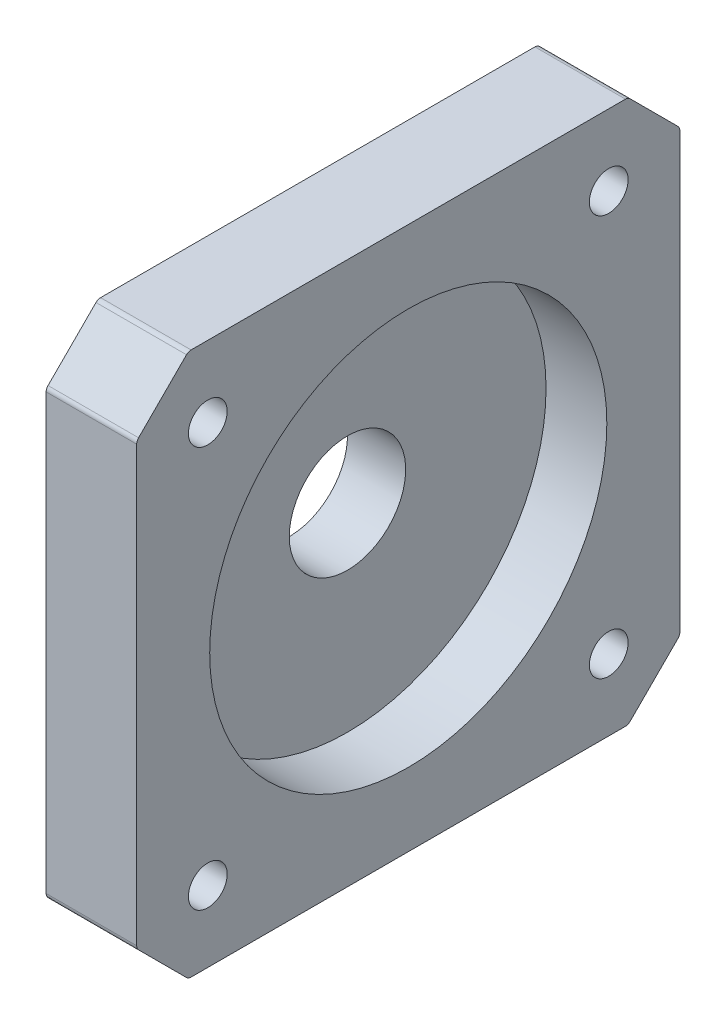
ISO-10303-21;
HEADER;
FILE_DESCRIPTION(('STEP AP214'),'2;1');
FILE_NAME('part.step','',(''),(''),'','','');
FILE_SCHEMA(('AUTOMOTIVE_DESIGN { 1 0 10303 214 1 1 1 1 }'));
ENDSEC;
DATA;
#1=APPLICATION_CONTEXT('core data for automotive mechanical design processes');
#2=APPLICATION_PROTOCOL_DEFINITION('international standard','automotive_design',2000,#1);
#3=PRODUCT_CONTEXT('',#1,'mechanical');
#4=PRODUCT('Part','Part','',(#3));
#5=PRODUCT_RELATED_PRODUCT_CATEGORY('part','',(#4));
#6=PRODUCT_DEFINITION_FORMATION('','',#4);
#7=PRODUCT_DEFINITION_CONTEXT('part definition',#1,'design');
#8=PRODUCT_DEFINITION('design','',#6,#7);
#9=PRODUCT_DEFINITION_SHAPE('','',#8);
#10=(LENGTH_UNIT() NAMED_UNIT(*) SI_UNIT(.MILLI.,.METRE.));
#11=(NAMED_UNIT(*) PLANE_ANGLE_UNIT() SI_UNIT($,.RADIAN.));
#12=(NAMED_UNIT(*) SI_UNIT($,.STERADIAN.) SOLID_ANGLE_UNIT());
#13=UNCERTAINTY_MEASURE_WITH_UNIT(LENGTH_MEASURE(1.E-05),#10,'distance_accuracy_value','');
#14=(GEOMETRIC_REPRESENTATION_CONTEXT(3) GLOBAL_UNCERTAINTY_ASSIGNED_CONTEXT((#13)) GLOBAL_UNIT_ASSIGNED_CONTEXT((#10,
#11,#12)) REPRESENTATION_CONTEXT('',''));
#15=CARTESIAN_POINT('',(0.,0.,0.));
#16=DIRECTION('',(0.,0.,1.));
#17=DIRECTION('',(1.,0.,0.));
#18=AXIS2_PLACEMENT_3D('',#15,#16,#17);
#19=CARTESIAN_POINT('',(-24.75,0.,0.));
#20=DIRECTION('',(-1.,0.,0.));
#21=DIRECTION('',(0.,0.,1.));
#22=AXIS2_PLACEMENT_3D('',#19,#20,#21);
#23=CYLINDRICAL_SURFACE('',#22,4.5);
#24=CARTESIAN_POINT('',(-31.1,0.,0.));
#25=DIRECTION('',(-1.,0.,0.));
#26=DIRECTION('',(0.,0.,1.));
#27=AXIS2_PLACEMENT_3D('',#24,#25,#26);
#28=CIRCLE('',#27,4.5);
#29=CARTESIAN_POINT('',(-31.1,0.,4.5));
#30=VERTEX_POINT('',#29);
#31=EDGE_CURVE('E326',#30,#30,#28,.F.);
#32=ORIENTED_EDGE('',*,*,#31,.F.);
#33=EDGE_LOOP('',(#32));
#34=FACE_BOUND('',#33,.T.);
#35=CARTESIAN_POINT('',(-26.6,0.,0.));
#36=DIRECTION('',(-1.,0.,0.));
#37=DIRECTION('',(0.,0.,1.));
#38=AXIS2_PLACEMENT_3D('',#35,#36,#37);
#39=CIRCLE('',#38,4.5);
#40=CARTESIAN_POINT('',(-26.6,0.,4.5));
#41=VERTEX_POINT('',#40);
#42=EDGE_CURVE('E322',#41,#41,#39,.T.);
#43=ORIENTED_EDGE('',*,*,#42,.F.);
#44=EDGE_LOOP('',(#43));
#45=FACE_BOUND('',#44,.T.);
#46=ADVANCED_FACE('F17',(#34,#45),#23,.F.);
#47=CARTESIAN_POINT('',(-31.1,0.,0.));
#48=DIRECTION('',(-1.,0.,0.));
#49=DIRECTION('',(0.,0.,1.));
#50=AXIS2_PLACEMENT_3D('',#47,#48,#49);
#51=PLANE('',#50);
#52=ORIENTED_EDGE('',*,*,#31,.T.);
#53=EDGE_LOOP('',(#52));
#54=FACE_BOUND('',#53,.T.);
#55=CARTESIAN_POINT('',(-31.1,0.,0.));
#56=DIRECTION('',(1.,0.,0.));
#57=DIRECTION('',(0.,1.,0.));
#58=AXIS2_PLACEMENT_3D('',#55,#56,#57);
#59=CIRCLE('',#58,10.6);
#60=CARTESIAN_POINT('',(-31.1,10.6,0.));
#61=VERTEX_POINT('',#60);
#62=CARTESIAN_POINT('',(-31.1,-10.6,0.));
#63=VERTEX_POINT('',#62);
#64=EDGE_CURVE('E321',#61,#63,#59,.T.);
#65=ORIENTED_EDGE('',*,*,#64,.F.);
#66=CARTESIAN_POINT('',(-31.1,0.,0.));
#67=DIRECTION('',(1.,0.,0.));
#68=DIRECTION('',(0.,-1.,0.));
#69=AXIS2_PLACEMENT_3D('',#66,#67,#68);
#70=CIRCLE('',#69,10.6);
#71=EDGE_CURVE('E325',#63,#61,#70,.T.);
#72=ORIENTED_EDGE('',*,*,#71,.F.);
#73=EDGE_LOOP('',(#65,#72));
#74=FACE_BOUND('',#73,.T.);
#75=ADVANCED_FACE('F336',(#54,#74),#51,.T.);
#76=CARTESIAN_POINT('',(-26.6,0.,0.));
#77=DIRECTION('',(1.,0.,0.));
#78=DIRECTION('',(0.,0.,-1.));
#79=AXIS2_PLACEMENT_3D('',#76,#77,#78);
#80=PLANE('',#79);
#81=ORIENTED_EDGE('',*,*,#42,.T.);
#82=EDGE_LOOP('',(#81));
#83=FACE_BOUND('',#82,.T.);
#84=CARTESIAN_POINT('',(-26.6,0.,0.));
#85=DIRECTION('',(1.,0.,0.));
#86=DIRECTION('',(0.,0.,-1.));
#87=AXIS2_PLACEMENT_3D('',#84,#85,#86);
#88=CIRCLE('',#87,15.3535883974);
#89=CARTESIAN_POINT('',(-26.6,0.,-15.3535883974));
#90=VERTEX_POINT('',#89);
#91=EDGE_CURVE('E318',#90,#90,#88,.T.);
#92=ORIENTED_EDGE('',*,*,#91,.T.);
#93=EDGE_LOOP('',(#92));
#94=FACE_BOUND('',#93,.T.);
#95=ADVANCED_FACE('F246',(#83,#94),#80,.T.);
#96=CARTESIAN_POINT('',(-30.7,0.,0.));
#97=DIRECTION('',(-1.,0.,0.));
#98=DIRECTION('',(0.,-1.,0.));
#99=AXIS2_PLACEMENT_3D('',#96,#97,#98);
#100=TOROIDAL_SURFACE('',#99,10.6,0.4);
#101=CARTESIAN_POINT('',(-30.7,0.,0.));
#102=DIRECTION('',(-1.,0.,0.));
#103=DIRECTION('',(0.,0.,1.));
#104=AXIS2_PLACEMENT_3D('',#101,#102,#103);
#105=CIRCLE('',#104,11.);
#106=CARTESIAN_POINT('',(-30.7,0.,11.));
#107=VERTEX_POINT('',#106);
#108=EDGE_CURVE('E238',#107,#107,#105,.F.);
#109=ORIENTED_EDGE('',*,*,#108,.F.);
#110=EDGE_LOOP('',(#109));
#111=FACE_BOUND('',#110,.T.);
#112=ORIENTED_EDGE('',*,*,#64,.T.);
#113=ORIENTED_EDGE('',*,*,#71,.T.);
#114=EDGE_LOOP('',(#112,#113));
#115=FACE_BOUND('',#114,.T.);
#116=ADVANCED_FACE('F240',(#111,#115),#100,.T.);
#117=CARTESIAN_POINT('',(-24.25,0.,0.));
#118=DIRECTION('',(1.,0.,0.));
#119=DIRECTION('',(0.,0.,-1.));
#120=AXIS2_PLACEMENT_3D('',#117,#118,#119);
#121=CYLINDRICAL_SURFACE('',#120,15.3535883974);
#122=CARTESIAN_POINT('',(-21.9,0.,0.));
#123=DIRECTION('',(1.,0.,0.));
#124=DIRECTION('',(0.,0.,-1.));
#125=AXIS2_PLACEMENT_3D('',#122,#123,#124);
#126=CIRCLE('',#125,15.3535883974);
#127=CARTESIAN_POINT('',(-21.9,0.,-15.3535883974));
#128=VERTEX_POINT('',#127);
#129=EDGE_CURVE('E292',#128,#128,#126,.T.);
#130=ORIENTED_EDGE('',*,*,#129,.T.);
#131=EDGE_LOOP('',(#130));
#132=FACE_BOUND('',#131,.T.);
#133=ORIENTED_EDGE('',*,*,#91,.F.);
#134=EDGE_LOOP('',(#133));
#135=FACE_BOUND('',#134,.T.);
#136=ADVANCED_FACE('F245',(#132,#135),#121,.F.);
#137=CARTESIAN_POINT('',(-29.75,0.,0.));
#138=DIRECTION('',(-1.,0.,0.));
#139=DIRECTION('',(0.,0.,1.));
#140=AXIS2_PLACEMENT_3D('',#137,#138,#139);
#141=CYLINDRICAL_SURFACE('',#140,11.);
#142=CARTESIAN_POINT('',(-28.4,0.,0.));
#143=DIRECTION('',(-1.,0.,0.));
#144=DIRECTION('',(0.,0.,1.));
#145=AXIS2_PLACEMENT_3D('',#142,#143,#144);
#146=CIRCLE('',#145,11.);
#147=CARTESIAN_POINT('',(-28.4,0.,11.));
#148=VERTEX_POINT('',#147);
#149=EDGE_CURVE('E210',#148,#148,#146,.F.);
#150=ORIENTED_EDGE('',*,*,#149,.F.);
#151=EDGE_LOOP('',(#150));
#152=FACE_BOUND('',#151,.T.);
#153=ORIENTED_EDGE('',*,*,#108,.T.);
#154=EDGE_LOOP('',(#153));
#155=FACE_BOUND('',#154,.T.);
#156=ADVANCED_FACE('F472',(#152,#155),#141,.T.);
#157=CARTESIAN_POINT('',(-25.4,-20.5,-16.7928932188));
#158=DIRECTION('',(-1.,0.,0.));
#159=DIRECTION('',(0.,0.,1.));
#160=AXIS2_PLACEMENT_3D('',#157,#158,#159);
#161=CYLINDRICAL_SURFACE('',#160,0.499999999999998);
#162=CARTESIAN_POINT('',(-21.9,-20.5,-16.7928932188));
#163=DIRECTION('',(-1.,0.,0.));
#164=DIRECTION('',(0.,0.,1.));
#165=AXIS2_PLACEMENT_3D('',#162,#163,#164);
#166=CIRCLE('',#165,0.499999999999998);
#167=CARTESIAN_POINT('',(-21.9,-20.8535533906,-17.1464466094));
#168=VERTEX_POINT('',#167);
#169=CARTESIAN_POINT('',(-21.9,-21.,-16.7928932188));
#170=VERTEX_POINT('',#169);
#171=EDGE_CURVE('E305',#168,#170,#166,.T.);
#172=ORIENTED_EDGE('',*,*,#171,.T.);
#173=DIRECTION('',(1.,0.,0.));
#174=VECTOR('',#173,1.);
#175=CARTESIAN_POINT('',(-21.9,-21.,-16.7928932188));
#176=LINE('',#175,#174);
#177=CARTESIAN_POINT('',(-28.9,-21.,-16.7928932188));
#178=VERTEX_POINT('',#177);
#179=EDGE_CURVE('E203',#178,#170,#176,.T.);
#180=ORIENTED_EDGE('',*,*,#179,.F.);
#181=CARTESIAN_POINT('',(-28.9,-20.5,-16.7928932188));
#182=DIRECTION('',(-1.,0.,0.));
#183=DIRECTION('',(0.,0.,1.));
#184=AXIS2_PLACEMENT_3D('',#181,#182,#183);
#185=CIRCLE('',#184,0.499999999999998);
#186=CARTESIAN_POINT('',(-28.9,-20.8535533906,-17.1464466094));
#187=VERTEX_POINT('',#186);
#188=EDGE_CURVE('E128',#178,#187,#185,.F.);
#189=ORIENTED_EDGE('',*,*,#188,.T.);
#190=DIRECTION('',(1.,0.,0.));
#191=VECTOR('',#190,1.);
#192=CARTESIAN_POINT('',(-20.5,-20.8535533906,-17.1464466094));
#193=LINE('',#192,#191);
#194=EDGE_CURVE('E152',#187,#168,#193,.T.);
#195=ORIENTED_EDGE('',*,*,#194,.T.);
#196=EDGE_LOOP('',(#172,#180,#189,#195));
#197=FACE_BOUND('',#196,.T.);
#198=ADVANCED_FACE('F469',(#197),#161,.T.);
#199=CARTESIAN_POINT('',(-25.4,-20.5,16.7928932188));
#200=DIRECTION('',(-1.,0.,0.));
#201=DIRECTION('',(0.,0.,1.));
#202=AXIS2_PLACEMENT_3D('',#199,#200,#201);
#203=CYLINDRICAL_SURFACE('',#202,0.5);
#204=CARTESIAN_POINT('',(-21.9,-20.5,16.7928932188));
#205=DIRECTION('',(-1.,0.,0.));
#206=DIRECTION('',(0.,0.,1.));
#207=AXIS2_PLACEMENT_3D('',#204,#205,#206);
#208=CIRCLE('',#207,0.5);
#209=CARTESIAN_POINT('',(-21.9,-21.,16.7928932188));
#210=VERTEX_POINT('',#209);
#211=CARTESIAN_POINT('',(-21.9,-20.8535533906,17.1464466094));
#212=VERTEX_POINT('',#211);
#213=EDGE_CURVE('E303',#210,#212,#208,.T.);
#214=ORIENTED_EDGE('',*,*,#213,.T.);
#215=DIRECTION('',(1.,0.,0.));
#216=VECTOR('',#215,1.);
#217=CARTESIAN_POINT('',(-20.5,-20.8535533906,17.1464466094));
#218=LINE('',#217,#216);
#219=CARTESIAN_POINT('',(-28.9,-20.8535533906,17.1464466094));
#220=VERTEX_POINT('',#219);
#221=EDGE_CURVE('E196',#220,#212,#218,.T.);
#222=ORIENTED_EDGE('',*,*,#221,.F.);
#223=CARTESIAN_POINT('',(-28.9,-20.5,16.7928932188));
#224=DIRECTION('',(-1.,0.,0.));
#225=DIRECTION('',(0.,0.,1.));
#226=AXIS2_PLACEMENT_3D('',#223,#224,#225);
#227=CIRCLE('',#226,0.5);
#228=CARTESIAN_POINT('',(-28.9,-21.,16.7928932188));
#229=VERTEX_POINT('',#228);
#230=EDGE_CURVE('E315',#220,#229,#227,.F.);
#231=ORIENTED_EDGE('',*,*,#230,.T.);
#232=DIRECTION('',(1.,0.,0.));
#233=VECTOR('',#232,1.);
#234=CARTESIAN_POINT('',(-21.9,-21.,16.7928932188));
#235=LINE('',#234,#233);
#236=EDGE_CURVE('E206',#210,#229,#235,.F.);
#237=ORIENTED_EDGE('',*,*,#236,.F.);
#238=EDGE_LOOP('',(#214,#222,#231,#237));
#239=FACE_BOUND('',#238,.T.);
#240=ADVANCED_FACE('F465',(#239),#203,.T.);
#241=CARTESIAN_POINT('',(-25.4,-16.7928932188,20.5));
#242=DIRECTION('',(-1.,0.,0.));
#243=DIRECTION('',(0.,0.,1.));
#244=AXIS2_PLACEMENT_3D('',#241,#242,#243);
#245=CYLINDRICAL_SURFACE('',#244,0.499999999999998);
#246=CARTESIAN_POINT('',(-21.9,-16.7928932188,20.5));
#247=DIRECTION('',(-1.,0.,0.));
#248=DIRECTION('',(0.,0.,1.));
#249=AXIS2_PLACEMENT_3D('',#246,#247,#248);
#250=CIRCLE('',#249,0.499999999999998);
#251=CARTESIAN_POINT('',(-21.9,-17.1464466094,20.8535533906));
#252=VERTEX_POINT('',#251);
#253=CARTESIAN_POINT('',(-21.9,-16.7928932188,21.));
#254=VERTEX_POINT('',#253);
#255=EDGE_CURVE('E301',#252,#254,#250,.T.);
#256=ORIENTED_EDGE('',*,*,#255,.T.);
#257=DIRECTION('',(-1.,0.,0.));
#258=VECTOR('',#257,1.);
#259=CARTESIAN_POINT('',(-21.9,-16.7928932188,21.));
#260=LINE('',#259,#258);
#261=CARTESIAN_POINT('',(-28.9,-16.7928932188,21.));
#262=VERTEX_POINT('',#261);
#263=EDGE_CURVE('E190',#254,#262,#260,.T.);
#264=ORIENTED_EDGE('',*,*,#263,.T.);
#265=CARTESIAN_POINT('',(-28.9,-16.7928932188,20.5));
#266=DIRECTION('',(-1.,0.,0.));
#267=DIRECTION('',(0.,0.,1.));
#268=AXIS2_PLACEMENT_3D('',#265,#266,#267);
#269=CIRCLE('',#268,0.499999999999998);
#270=CARTESIAN_POINT('',(-28.9,-17.1464466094,20.8535533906));
#271=VERTEX_POINT('',#270);
#272=EDGE_CURVE('E313',#262,#271,#269,.F.);
#273=ORIENTED_EDGE('',*,*,#272,.T.);
#274=DIRECTION('',(1.,0.,0.));
#275=VECTOR('',#274,1.);
#276=CARTESIAN_POINT('',(-20.5,-17.1464466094,20.8535533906));
#277=LINE('',#276,#275);
#278=EDGE_CURVE('E199',#252,#271,#277,.F.);
#279=ORIENTED_EDGE('',*,*,#278,.F.);
#280=EDGE_LOOP('',(#256,#264,#273,#279));
#281=FACE_BOUND('',#280,.T.);
#282=ADVANCED_FACE('F461',(#281),#245,.T.);
#283=CARTESIAN_POINT('',(-25.4,16.7928932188,20.5));
#284=DIRECTION('',(-1.,0.,0.));
#285=DIRECTION('',(0.,0.,1.));
#286=AXIS2_PLACEMENT_3D('',#283,#284,#285);
#287=CYLINDRICAL_SURFACE('',#286,0.5);
#288=CARTESIAN_POINT('',(-21.9,16.7928932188,20.5));
#289=DIRECTION('',(-1.,0.,0.));
#290=DIRECTION('',(0.,0.,1.));
#291=AXIS2_PLACEMENT_3D('',#288,#289,#290);
#292=CIRCLE('',#291,0.5);
#293=CARTESIAN_POINT('',(-21.9,16.7928932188,21.));
#294=VERTEX_POINT('',#293);
#295=CARTESIAN_POINT('',(-21.9,17.1464466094,20.8535533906));
#296=VERTEX_POINT('',#295);
#297=EDGE_CURVE('E299',#294,#296,#292,.T.);
#298=ORIENTED_EDGE('',*,*,#297,.T.);
#299=DIRECTION('',(1.,0.,0.));
#300=VECTOR('',#299,1.);
#301=CARTESIAN_POINT('',(-20.5,17.1464466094,20.8535533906));
#302=LINE('',#301,#300);
#303=CARTESIAN_POINT('',(-28.9,17.1464466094,20.8535533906));
#304=VERTEX_POINT('',#303);
#305=EDGE_CURVE('E184',#296,#304,#302,.F.);
#306=ORIENTED_EDGE('',*,*,#305,.T.);
#307=CARTESIAN_POINT('',(-28.9,16.7928932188,20.5));
#308=DIRECTION('',(-1.,0.,0.));
#309=DIRECTION('',(0.,0.,1.));
#310=AXIS2_PLACEMENT_3D('',#307,#308,#309);
#311=CIRCLE('',#310,0.5);
#312=CARTESIAN_POINT('',(-28.9,16.7928932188,21.));
#313=VERTEX_POINT('',#312);
#314=EDGE_CURVE('E311',#304,#313,#311,.F.);
#315=ORIENTED_EDGE('',*,*,#314,.T.);
#316=DIRECTION('',(-1.,0.,0.));
#317=VECTOR('',#316,1.);
#318=CARTESIAN_POINT('',(-21.9,16.7928932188,21.));
#319=LINE('',#318,#317);
#320=EDGE_CURVE('E194',#313,#294,#319,.F.);
#321=ORIENTED_EDGE('',*,*,#320,.T.);
#322=EDGE_LOOP('',(#298,#306,#315,#321));
#323=FACE_BOUND('',#322,.T.);
#324=ADVANCED_FACE('F457',(#323),#287,.T.);
#325=CARTESIAN_POINT('',(-25.4,20.5,16.7928932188));
#326=DIRECTION('',(-1.,0.,0.));
#327=DIRECTION('',(0.,0.,1.));
#328=AXIS2_PLACEMENT_3D('',#325,#326,#327);
#329=CYLINDRICAL_SURFACE('',#328,0.499999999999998);
#330=CARTESIAN_POINT('',(-21.9,20.5,16.7928932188));
#331=DIRECTION('',(-1.,0.,0.));
#332=DIRECTION('',(0.,0.,1.));
#333=AXIS2_PLACEMENT_3D('',#330,#331,#332);
#334=CIRCLE('',#333,0.499999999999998);
#335=CARTESIAN_POINT('',(-21.9,20.8535533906,17.1464466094));
#336=VERTEX_POINT('',#335);
#337=CARTESIAN_POINT('',(-21.9,21.,16.7928932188));
#338=VERTEX_POINT('',#337);
#339=EDGE_CURVE('E297',#336,#338,#334,.T.);
#340=ORIENTED_EDGE('',*,*,#339,.T.);
#341=DIRECTION('',(1.,0.,0.));
#342=VECTOR('',#341,1.);
#343=CARTESIAN_POINT('',(-21.9,21.,16.7928932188));
#344=LINE('',#343,#342);
#345=CARTESIAN_POINT('',(-28.9,21.,16.7928932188));
#346=VERTEX_POINT('',#345);
#347=EDGE_CURVE('E177',#346,#338,#344,.T.);
#348=ORIENTED_EDGE('',*,*,#347,.F.);
#349=CARTESIAN_POINT('',(-28.9,20.5,16.7928932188));
#350=DIRECTION('',(-1.,0.,0.));
#351=DIRECTION('',(0.,0.,1.));
#352=AXIS2_PLACEMENT_3D('',#349,#350,#351);
#353=CIRCLE('',#352,0.499999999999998);
#354=CARTESIAN_POINT('',(-28.9,20.8535533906,17.1464466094));
#355=VERTEX_POINT('',#354);
#356=EDGE_CURVE('E309',#346,#355,#353,.F.);
#357=ORIENTED_EDGE('',*,*,#356,.T.);
#358=DIRECTION('',(1.,0.,0.));
#359=VECTOR('',#358,1.);
#360=CARTESIAN_POINT('',(-20.5,20.8535533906,17.1464466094));
#361=LINE('',#360,#359);
#362=EDGE_CURVE('E188',#355,#336,#361,.T.);
#363=ORIENTED_EDGE('',*,*,#362,.T.);
#364=EDGE_LOOP('',(#340,#348,#357,#363));
#365=FACE_BOUND('',#364,.T.);
#366=ADVANCED_FACE('F453',(#365),#329,.T.);
#367=CARTESIAN_POINT('',(-25.4,20.5,-16.7928932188));
#368=DIRECTION('',(-1.,0.,0.));
#369=DIRECTION('',(0.,0.,1.));
#370=AXIS2_PLACEMENT_3D('',#367,#368,#369);
#371=CYLINDRICAL_SURFACE('',#370,0.5);
#372=CARTESIAN_POINT('',(-21.9,20.5,-16.7928932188));
#373=DIRECTION('',(-1.,0.,0.));
#374=DIRECTION('',(0.,0.,1.));
#375=AXIS2_PLACEMENT_3D('',#372,#373,#374);
#376=CIRCLE('',#375,0.5);
#377=CARTESIAN_POINT('',(-21.9,21.,-16.7928932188));
#378=VERTEX_POINT('',#377);
#379=CARTESIAN_POINT('',(-21.9,20.8535533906,-17.1464466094));
#380=VERTEX_POINT('',#379);
#381=EDGE_CURVE('E295',#378,#380,#376,.T.);
#382=ORIENTED_EDGE('',*,*,#381,.T.);
#383=DIRECTION('',(1.,0.,0.));
#384=VECTOR('',#383,1.);
#385=CARTESIAN_POINT('',(-20.5,20.8535533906,-17.1464466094));
#386=LINE('',#385,#384);
#387=CARTESIAN_POINT('',(-28.9,20.8535533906,-17.1464466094));
#388=VERTEX_POINT('',#387);
#389=EDGE_CURVE('E170',#388,#380,#386,.T.);
#390=ORIENTED_EDGE('',*,*,#389,.F.);
#391=CARTESIAN_POINT('',(-28.9,20.5,-16.7928932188));
#392=DIRECTION('',(-1.,0.,0.));
#393=DIRECTION('',(0.,0.,1.));
#394=AXIS2_PLACEMENT_3D('',#391,#392,#393);
#395=CIRCLE('',#394,0.5);
#396=CARTESIAN_POINT('',(-28.9,21.,-16.7928932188));
#397=VERTEX_POINT('',#396);
#398=EDGE_CURVE('E307',#388,#397,#395,.F.);
#399=ORIENTED_EDGE('',*,*,#398,.T.);
#400=DIRECTION('',(1.,0.,0.));
#401=VECTOR('',#400,1.);
#402=CARTESIAN_POINT('',(-21.9,21.,-16.7928932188));
#403=LINE('',#402,#401);
#404=EDGE_CURVE('E180',#378,#397,#403,.F.);
#405=ORIENTED_EDGE('',*,*,#404,.F.);
#406=EDGE_LOOP('',(#382,#390,#399,#405));
#407=FACE_BOUND('',#406,.T.);
#408=ADVANCED_FACE('F449',(#407),#371,.T.);
#409=CARTESIAN_POINT('',(-21.9,0.,0.));
#410=DIRECTION('',(-1.,0.,0.));
#411=DIRECTION('',(0.,0.,1.));
#412=AXIS2_PLACEMENT_3D('',#409,#410,#411);
#413=PLANE('',#412);
#414=CARTESIAN_POINT('',(-21.9,15.5,15.5));
#415=DIRECTION('',(-1.,0.,0.));
#416=DIRECTION('',(0.,0.,1.));
#417=AXIS2_PLACEMENT_3D('',#414,#415,#416);
#418=CIRCLE('',#417,1.5);
#419=CARTESIAN_POINT('',(-21.9,15.5,17.));
#420=VERTEX_POINT('',#419);
#421=EDGE_CURVE('E278',#420,#420,#418,.T.);
#422=ORIENTED_EDGE('',*,*,#421,.T.);
#423=EDGE_LOOP('',(#422));
#424=FACE_BOUND('',#423,.T.);
#425=CARTESIAN_POINT('',(-21.9,-15.5,15.5));
#426=DIRECTION('',(-1.,0.,0.));
#427=DIRECTION('',(0.,0.,1.));
#428=AXIS2_PLACEMENT_3D('',#425,#426,#427);
#429=CIRCLE('',#428,1.5);
#430=CARTESIAN_POINT('',(-21.9,-15.5,17.));
#431=VERTEX_POINT('',#430);
#432=EDGE_CURVE('E275',#431,#431,#429,.T.);
#433=ORIENTED_EDGE('',*,*,#432,.T.);
#434=EDGE_LOOP('',(#433));
#435=FACE_BOUND('',#434,.T.);
#436=CARTESIAN_POINT('',(-21.9,15.5,-15.5));
#437=DIRECTION('',(-1.,0.,0.));
#438=DIRECTION('',(0.,0.,1.));
#439=AXIS2_PLACEMENT_3D('',#436,#437,#438);
#440=CIRCLE('',#439,1.5);
#441=CARTESIAN_POINT('',(-21.9,15.5,-14.));
#442=VERTEX_POINT('',#441);
#443=EDGE_CURVE('E281',#442,#442,#440,.T.);
#444=ORIENTED_EDGE('',*,*,#443,.T.);
#445=EDGE_LOOP('',(#444));
#446=FACE_BOUND('',#445,.T.);
#447=CARTESIAN_POINT('',(-21.9,-15.5,-15.5));
#448=DIRECTION('',(-1.,0.,0.));
#449=DIRECTION('',(0.,0.,1.));
#450=AXIS2_PLACEMENT_3D('',#447,#448,#449);
#451=CIRCLE('',#450,1.5);
#452=CARTESIAN_POINT('',(-21.9,-15.5,-14.));
#453=VERTEX_POINT('',#452);
#454=EDGE_CURVE('E284',#453,#453,#451,.T.);
#455=ORIENTED_EDGE('',*,*,#454,.T.);
#456=EDGE_LOOP('',(#455));
#457=FACE_BOUND('',#456,.T.);
#458=ORIENTED_EDGE('',*,*,#129,.F.);
#459=EDGE_LOOP('',(#458));
#460=FACE_BOUND('',#459,.T.);
#461=DIRECTION('',(0.,1.,0.));
#462=VECTOR('',#461,1.);
#463=CARTESIAN_POINT('',(-21.9,-21.,-21.));
#464=LINE('',#463,#462);
#465=CARTESIAN_POINT('',(-21.9,-16.7928932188,-21.));
#466=VERTEX_POINT('',#465);
#467=CARTESIAN_POINT('',(-21.9,16.7928932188,-21.));
#468=VERTEX_POINT('',#467);
#469=EDGE_CURVE('E167',#466,#468,#464,.T.);
#470=ORIENTED_EDGE('',*,*,#469,.T.);
#471=CARTESIAN_POINT('',(-21.9,16.7928932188,-20.5));
#472=DIRECTION('',(-1.,0.,0.));
#473=DIRECTION('',(0.,0.,1.));
#474=AXIS2_PLACEMENT_3D('',#471,#472,#473);
#475=CIRCLE('',#474,0.499999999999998);
#476=CARTESIAN_POINT('',(-21.9,17.1464466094,-20.8535533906));
#477=VERTEX_POINT('',#476);
#478=EDGE_CURVE('E139',#477,#468,#475,.T.);
#479=ORIENTED_EDGE('',*,*,#478,.F.);
#480=DIRECTION('',(0.,0.707106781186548,0.707106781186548));
#481=VECTOR('',#480,1.);
#482=CARTESIAN_POINT('',(-21.9,17.,-21.));
#483=LINE('',#482,#481);
#484=EDGE_CURVE('E176',#380,#477,#483,.F.);
#485=ORIENTED_EDGE('',*,*,#484,.F.);
#486=ORIENTED_EDGE('',*,*,#381,.F.);
#487=DIRECTION('',(0.,0.,1.));
#488=VECTOR('',#487,1.);
#489=CARTESIAN_POINT('',(-21.9,21.,21.));
#490=LINE('',#489,#488);
#491=EDGE_CURVE('E183',#338,#378,#490,.F.);
#492=ORIENTED_EDGE('',*,*,#491,.F.);
#493=ORIENTED_EDGE('',*,*,#339,.F.);
#494=DIRECTION('',(0.,0.707106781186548,-0.707106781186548));
#495=VECTOR('',#494,1.);
#496=CARTESIAN_POINT('',(-21.9,17.,21.));
#497=LINE('',#496,#495);
#498=EDGE_CURVE('E187',#336,#296,#497,.F.);
#499=ORIENTED_EDGE('',*,*,#498,.T.);
#500=ORIENTED_EDGE('',*,*,#297,.F.);
#501=DIRECTION('',(0.,1.,0.));
#502=VECTOR('',#501,1.);
#503=CARTESIAN_POINT('',(-21.9,21.,21.));
#504=LINE('',#503,#502);
#505=EDGE_CURVE('E193',#294,#254,#504,.F.);
#506=ORIENTED_EDGE('',*,*,#505,.T.);
#507=ORIENTED_EDGE('',*,*,#255,.F.);
#508=DIRECTION('',(0.,-0.707106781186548,-0.707106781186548));
#509=VECTOR('',#508,1.);
#510=CARTESIAN_POINT('',(-21.9,-17.,21.));
#511=LINE('',#510,#509);
#512=EDGE_CURVE('E202',#212,#252,#511,.F.);
#513=ORIENTED_EDGE('',*,*,#512,.F.);
#514=ORIENTED_EDGE('',*,*,#213,.F.);
#515=DIRECTION('',(0.,0.,-1.));
#516=VECTOR('',#515,1.);
#517=CARTESIAN_POINT('',(-21.9,-21.,-21.));
#518=LINE('',#517,#516);
#519=EDGE_CURVE('E148',#170,#210,#518,.F.);
#520=ORIENTED_EDGE('',*,*,#519,.F.);
#521=ORIENTED_EDGE('',*,*,#171,.F.);
#522=DIRECTION('',(0.,-0.707106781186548,0.707106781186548));
#523=VECTOR('',#522,1.);
#524=CARTESIAN_POINT('',(-21.9,-17.,-21.));
#525=LINE('',#524,#523);
#526=CARTESIAN_POINT('',(-21.9,-17.1464466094,-20.8535533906));
#527=VERTEX_POINT('',#526);
#528=EDGE_CURVE('E149',#168,#527,#525,.F.);
#529=ORIENTED_EDGE('',*,*,#528,.T.);
#530=CARTESIAN_POINT('',(-21.9,-16.7928932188,-20.5));
#531=DIRECTION('',(-1.,0.,0.));
#532=DIRECTION('',(0.,0.,1.));
#533=AXIS2_PLACEMENT_3D('',#530,#531,#532);
#534=CIRCLE('',#533,0.5);
#535=EDGE_CURVE('E138',#466,#527,#534,.T.);
#536=ORIENTED_EDGE('',*,*,#535,.F.);
#537=EDGE_LOOP('',(#470,#479,#485,#486,#492,#493,#499,#500,#506,#507,#513,#514,#520,#521,#529,#536));
#538=FACE_BOUND('',#537,.T.);
#539=ADVANCED_FACE('F445',(#424,#435,#446,#457,#460,#538),#413,.F.);
#540=CARTESIAN_POINT('',(-25.4,16.7928932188,-20.5));
#541=DIRECTION('',(-1.,0.,0.));
#542=DIRECTION('',(0.,0.,1.));
#543=AXIS2_PLACEMENT_3D('',#540,#541,#542);
#544=CYLINDRICAL_SURFACE('',#543,0.499999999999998);
#545=ORIENTED_EDGE('',*,*,#478,.T.);
#546=DIRECTION('',(1.,0.,0.));
#547=VECTOR('',#546,1.);
#548=CARTESIAN_POINT('',(-21.9,16.7928932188,-21.));
#549=LINE('',#548,#547);
#550=CARTESIAN_POINT('',(-28.9,16.7928932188,-21.));
#551=VERTEX_POINT('',#550);
#552=EDGE_CURVE('E163',#468,#551,#549,.F.);
#553=ORIENTED_EDGE('',*,*,#552,.T.);
#554=CARTESIAN_POINT('',(-28.9,16.7928932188,-20.5));
#555=DIRECTION('',(-1.,0.,0.));
#556=DIRECTION('',(0.,0.,1.));
#557=AXIS2_PLACEMENT_3D('',#554,#555,#556);
#558=CIRCLE('',#557,0.499999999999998);
#559=CARTESIAN_POINT('',(-28.9,17.1464466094,-20.8535533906));
#560=VERTEX_POINT('',#559);
#561=EDGE_CURVE('E290',#551,#560,#558,.F.);
#562=ORIENTED_EDGE('',*,*,#561,.T.);
#563=DIRECTION('',(1.,0.,0.));
#564=VECTOR('',#563,1.);
#565=CARTESIAN_POINT('',(-20.5,17.1464466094,-20.8535533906));
#566=LINE('',#565,#564);
#567=EDGE_CURVE('E173',#477,#560,#566,.F.);
#568=ORIENTED_EDGE('',*,*,#567,.F.);
#569=EDGE_LOOP('',(#545,#553,#562,#568));
#570=FACE_BOUND('',#569,.T.);
#571=ADVANCED_FACE('F442',(#570),#544,.T.);
#572=CARTESIAN_POINT('',(-25.4,-16.7928932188,-20.5));
#573=DIRECTION('',(-1.,0.,0.));
#574=DIRECTION('',(0.,0.,1.));
#575=AXIS2_PLACEMENT_3D('',#572,#573,#574);
#576=CYLINDRICAL_SURFACE('',#575,0.5);
#577=ORIENTED_EDGE('',*,*,#535,.T.);
#578=DIRECTION('',(1.,0.,0.));
#579=VECTOR('',#578,1.);
#580=CARTESIAN_POINT('',(-20.5,-17.1464466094,-20.8535533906));
#581=LINE('',#580,#579);
#582=CARTESIAN_POINT('',(-28.9,-17.1464466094,-20.8535533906));
#583=VERTEX_POINT('',#582);
#584=EDGE_CURVE('E143',#527,#583,#581,.F.);
#585=ORIENTED_EDGE('',*,*,#584,.T.);
#586=CARTESIAN_POINT('',(-28.9,-16.7928932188,-20.5));
#587=DIRECTION('',(-1.,0.,0.));
#588=DIRECTION('',(0.,0.,1.));
#589=AXIS2_PLACEMENT_3D('',#586,#587,#588);
#590=CIRCLE('',#589,0.5);
#591=CARTESIAN_POINT('',(-28.9,-16.7928932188,-21.));
#592=VERTEX_POINT('',#591);
#593=EDGE_CURVE('E37',#583,#592,#590,.F.);
#594=ORIENTED_EDGE('',*,*,#593,.T.);
#595=DIRECTION('',(1.,0.,0.));
#596=VECTOR('',#595,1.);
#597=CARTESIAN_POINT('',(-21.9,-16.7928932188,-21.));
#598=LINE('',#597,#596);
#599=EDGE_CURVE('E166',#592,#466,#598,.T.);
#600=ORIENTED_EDGE('',*,*,#599,.T.);
#601=EDGE_LOOP('',(#577,#585,#594,#600));
#602=FACE_BOUND('',#601,.T.);
#603=ADVANCED_FACE('F144',(#602),#576,.T.);
#604=CARTESIAN_POINT('',(-25.4,-15.5,-15.5));
#605=DIRECTION('',(-1.,0.,0.));
#606=DIRECTION('',(0.,0.,1.));
#607=AXIS2_PLACEMENT_3D('',#604,#605,#606);
#608=CYLINDRICAL_SURFACE('',#607,1.5);
#609=ORIENTED_EDGE('',*,*,#454,.F.);
#610=EDGE_LOOP('',(#609));
#611=FACE_BOUND('',#610,.T.);
#612=CARTESIAN_POINT('',(-28.4000000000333,-15.5,-15.5));
#613=DIRECTION('',(-1.,0.,0.));
#614=DIRECTION('',(0.,-0.499999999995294,-0.866025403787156));
#615=AXIS2_PLACEMENT_3D('',#612,#613,#614);
#616=CIRCLE('',#615,1.5000000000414);
#617=CARTESIAN_POINT('',(-28.4000000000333,-16.2500000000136,-16.7990381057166));
#618=VERTEX_POINT('',#617);
#619=EDGE_CURVE('E169',#618,#618,#616,.T.);
#620=ORIENTED_EDGE('',*,*,#619,.T.);
#621=EDGE_LOOP('',(#620));
#622=FACE_BOUND('',#621,.T.);
#623=ADVANCED_FACE('F435',(#611,#622),#608,.F.);
#624=CARTESIAN_POINT('',(-25.4,15.5,-15.5));
#625=DIRECTION('',(-1.,0.,0.));
#626=DIRECTION('',(0.,0.,1.));
#627=AXIS2_PLACEMENT_3D('',#624,#625,#626);
#628=CYLINDRICAL_SURFACE('',#627,1.5);
#629=ORIENTED_EDGE('',*,*,#443,.F.);
#630=EDGE_LOOP('',(#629));
#631=FACE_BOUND('',#630,.T.);
#632=CARTESIAN_POINT('',(-28.3999999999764,15.5,-15.5));
#633=DIRECTION('',(-1.,0.,0.));
#634=DIRECTION('',(0.,-0.500000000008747,-0.866025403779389));
#635=AXIS2_PLACEMENT_3D('',#632,#633,#634);
#636=CIRCLE('',#635,1.49999999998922);
#637=CARTESIAN_POINT('',(-28.3999999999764,14.7499999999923,-16.7990381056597));
#638=VERTEX_POINT('',#637);
#639=EDGE_CURVE('E216',#638,#638,#636,.T.);
#640=ORIENTED_EDGE('',*,*,#639,.T.);
#641=EDGE_LOOP('',(#640));
#642=FACE_BOUND('',#641,.T.);
#643=ADVANCED_FACE('F431',(#631,#642),#628,.F.);
#644=CARTESIAN_POINT('',(-25.4,15.5,15.5));
#645=DIRECTION('',(-1.,0.,0.));
#646=DIRECTION('',(0.,0.,1.));
#647=AXIS2_PLACEMENT_3D('',#644,#645,#646);
#648=CYLINDRICAL_SURFACE('',#647,1.5);
#649=ORIENTED_EDGE('',*,*,#421,.F.);
#650=EDGE_LOOP('',(#649));
#651=FACE_BOUND('',#650,.T.);
#652=CARTESIAN_POINT('',(-28.3999999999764,15.5,15.5));
#653=DIRECTION('',(-1.,0.,0.));
#654=DIRECTION('',(0.,-0.500000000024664,-0.866025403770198));
#655=AXIS2_PLACEMENT_3D('',#652,#653,#654);
#656=CIRCLE('',#655,1.49999999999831);
#657=CARTESIAN_POINT('',(-28.3999999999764,14.7499999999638,14.2009618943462));
#658=VERTEX_POINT('',#657);
#659=EDGE_CURVE('E213',#658,#658,#656,.T.);
#660=ORIENTED_EDGE('',*,*,#659,.T.);
#661=EDGE_LOOP('',(#660));
#662=FACE_BOUND('',#661,.T.);
#663=ADVANCED_FACE('F427',(#651,#662),#648,.F.);
#664=CARTESIAN_POINT('',(-25.4,-15.5,15.5));
#665=DIRECTION('',(-1.,0.,0.));
#666=DIRECTION('',(0.,0.,1.));
#667=AXIS2_PLACEMENT_3D('',#664,#665,#666);
#668=CYLINDRICAL_SURFACE('',#667,1.5);
#669=ORIENTED_EDGE('',*,*,#432,.F.);
#670=EDGE_LOOP('',(#669));
#671=FACE_BOUND('',#670,.T.);
#672=CARTESIAN_POINT('',(-28.4000000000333,-15.5,15.5));
#673=DIRECTION('',(-1.,0.,0.));
#674=DIRECTION('',(0.,-0.50000000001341,-0.866025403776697));
#675=AXIS2_PLACEMENT_3D('',#672,#673,#674);
#676=CIRCLE('',#675,1.49999999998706);
#677=CARTESIAN_POINT('',(-28.4000000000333,-16.2500000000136,14.2009618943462));
#678=VERTEX_POINT('',#677);
#679=EDGE_CURVE('E159',#678,#678,#676,.T.);
#680=ORIENTED_EDGE('',*,*,#679,.T.);
#681=EDGE_LOOP('',(#680));
#682=FACE_BOUND('',#681,.T.);
#683=ADVANCED_FACE('F423',(#671,#682),#668,.F.);
#684=CARTESIAN_POINT('',(-28.4,0.,0.));
#685=DIRECTION('',(-1.,0.,0.));
#686=DIRECTION('',(0.,0.,1.));
#687=AXIS2_PLACEMENT_3D('',#684,#685,#686);
#688=PLANE('',#687);
#689=ORIENTED_EDGE('',*,*,#149,.T.);
#690=EDGE_LOOP('',(#689));
#691=FACE_BOUND('',#690,.T.);
#692=CARTESIAN_POINT('',(-28.4000000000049,0.,0.));
#693=DIRECTION('',(-1.,0.,0.));
#694=DIRECTION('',(0.,0.,1.));
#695=AXIS2_PLACEMENT_3D('',#692,#693,#694);
#696=CIRCLE('',#695,13.5000000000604);
#697=CARTESIAN_POINT('',(-28.4000000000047,0.,13.5000000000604));
#698=VERTEX_POINT('',#697);
#699=EDGE_CURVE('E154',#698,#698,#696,.T.);
#700=ORIENTED_EDGE('',*,*,#699,.T.);
#701=EDGE_LOOP('',(#700));
#702=FACE_BOUND('',#701,.T.);
#703=ADVANCED_FACE('F420',(#691,#702),#688,.T.);
#704=CARTESIAN_POINT('',(-20.5,-17.,-21.));
#705=DIRECTION('',(0.,0.707106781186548,0.707106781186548));
#706=DIRECTION('',(0.,-0.707106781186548,0.707106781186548));
#707=AXIS2_PLACEMENT_3D('',#704,#705,#706);
#708=PLANE('',#707);
#709=ORIENTED_EDGE('',*,*,#528,.F.);
#710=ORIENTED_EDGE('',*,*,#194,.F.);
#711=DIRECTION('',(0.,-0.707106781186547,0.707106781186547));
#712=VECTOR('',#711,1.);
#713=CARTESIAN_POINT('',(-28.9,-17.1464466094,-20.8535533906));
#714=LINE('',#713,#712);
#715=EDGE_CURVE('E135',#583,#187,#714,.T.);
#716=ORIENTED_EDGE('',*,*,#715,.F.);
#717=ORIENTED_EDGE('',*,*,#584,.F.);
#718=EDGE_LOOP('',(#709,#710,#716,#717));
#719=FACE_BOUND('',#718,.T.);
#720=ADVANCED_FACE('F151',(#719),#708,.F.);
#721=CARTESIAN_POINT('',(-21.9,-21.,-21.));
#722=DIRECTION('',(0.,-1.,0.));
#723=DIRECTION('',(0.,0.,-1.));
#724=AXIS2_PLACEMENT_3D('',#721,#722,#723);
#725=PLANE('',#724);
#726=DIRECTION('',(0.,0.,1.));
#727=VECTOR('',#726,1.);
#728=CARTESIAN_POINT('',(-28.9,-21.,0.));
#729=LINE('',#728,#727);
#730=EDGE_CURVE('E153',#178,#229,#729,.T.);
#731=ORIENTED_EDGE('',*,*,#730,.F.);
#732=ORIENTED_EDGE('',*,*,#179,.T.);
#733=ORIENTED_EDGE('',*,*,#519,.T.);
#734=ORIENTED_EDGE('',*,*,#236,.T.);
#735=EDGE_LOOP('',(#731,#732,#733,#734));
#736=FACE_BOUND('',#735,.T.);
#737=ADVANCED_FACE('F413',(#736),#725,.T.);
#738=CARTESIAN_POINT('',(-20.5,-17.,21.));
#739=DIRECTION('',(0.,-0.707106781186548,0.707106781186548));
#740=DIRECTION('',(0.,-0.707106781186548,-0.707106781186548));
#741=AXIS2_PLACEMENT_3D('',#738,#739,#740);
#742=PLANE('',#741);
#743=DIRECTION('',(0.,0.707106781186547,0.707106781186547));
#744=VECTOR('',#743,1.);
#745=CARTESIAN_POINT('',(-28.9,-20.8535533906,17.1464466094));
#746=LINE('',#745,#744);
#747=EDGE_CURVE('E156',#220,#271,#746,.T.);
#748=ORIENTED_EDGE('',*,*,#747,.F.);
#749=ORIENTED_EDGE('',*,*,#221,.T.);
#750=ORIENTED_EDGE('',*,*,#512,.T.);
#751=ORIENTED_EDGE('',*,*,#278,.T.);
#752=EDGE_LOOP('',(#748,#749,#750,#751));
#753=FACE_BOUND('',#752,.T.);
#754=ADVANCED_FACE('F409',(#753),#742,.T.);
#755=CARTESIAN_POINT('',(-21.9,21.,21.));
#756=DIRECTION('',(0.,0.,-1.));
#757=DIRECTION('',(-1.,0.,0.));
#758=AXIS2_PLACEMENT_3D('',#755,#756,#757);
#759=PLANE('',#758);
#760=ORIENTED_EDGE('',*,*,#505,.F.);
#761=ORIENTED_EDGE('',*,*,#320,.F.);
#762=DIRECTION('',(0.,1.,0.));
#763=VECTOR('',#762,1.);
#764=CARTESIAN_POINT('',(-28.9,0.,21.));
#765=LINE('',#764,#763);
#766=EDGE_CURVE('E509',#262,#313,#765,.T.);
#767=ORIENTED_EDGE('',*,*,#766,.F.);
#768=ORIENTED_EDGE('',*,*,#263,.F.);
#769=EDGE_LOOP('',(#760,#761,#767,#768));
#770=FACE_BOUND('',#769,.T.);
#771=ADVANCED_FACE('F405',(#770),#759,.F.);
#772=CARTESIAN_POINT('',(-20.5,17.,21.));
#773=DIRECTION('',(0.,-0.707106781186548,-0.707106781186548));
#774=DIRECTION('',(0.,0.707106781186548,-0.707106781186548));
#775=AXIS2_PLACEMENT_3D('',#772,#773,#774);
#776=PLANE('',#775);
#777=ORIENTED_EDGE('',*,*,#498,.F.);
#778=ORIENTED_EDGE('',*,*,#362,.F.);
#779=DIRECTION('',(0.,0.707106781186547,-0.707106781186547));
#780=VECTOR('',#779,1.);
#781=CARTESIAN_POINT('',(-28.9,17.1464466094,20.8535533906));
#782=LINE('',#781,#780);
#783=EDGE_CURVE('E506',#304,#355,#782,.T.);
#784=ORIENTED_EDGE('',*,*,#783,.F.);
#785=ORIENTED_EDGE('',*,*,#305,.F.);
#786=EDGE_LOOP('',(#777,#778,#784,#785));
#787=FACE_BOUND('',#786,.T.);
#788=ADVANCED_FACE('F401',(#787),#776,.F.);
#789=CARTESIAN_POINT('',(-21.9,21.,21.));
#790=DIRECTION('',(0.,1.,0.));
#791=DIRECTION('',(0.,0.,1.));
#792=AXIS2_PLACEMENT_3D('',#789,#790,#791);
#793=PLANE('',#792);
#794=DIRECTION('',(0.,0.,1.));
#795=VECTOR('',#794,1.);
#796=CARTESIAN_POINT('',(-28.9,21.,0.));
#797=LINE('',#796,#795);
#798=EDGE_CURVE('E501',#346,#397,#797,.F.);
#799=ORIENTED_EDGE('',*,*,#798,.F.);
#800=ORIENTED_EDGE('',*,*,#347,.T.);
#801=ORIENTED_EDGE('',*,*,#491,.T.);
#802=ORIENTED_EDGE('',*,*,#404,.T.);
#803=EDGE_LOOP('',(#799,#800,#801,#802));
#804=FACE_BOUND('',#803,.T.);
#805=ADVANCED_FACE('F397',(#804),#793,.T.);
#806=CARTESIAN_POINT('',(-20.5,17.,-21.));
#807=DIRECTION('',(0.,0.707106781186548,-0.707106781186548));
#808=DIRECTION('',(0.,0.707106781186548,0.707106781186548));
#809=AXIS2_PLACEMENT_3D('',#806,#807,#808);
#810=PLANE('',#809);
#811=DIRECTION('',(0.,-0.707106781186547,-0.707106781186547));
#812=VECTOR('',#811,1.);
#813=CARTESIAN_POINT('',(-28.9,20.8535533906,-17.1464466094));
#814=LINE('',#813,#812);
#815=EDGE_CURVE('E498',#388,#560,#814,.T.);
#816=ORIENTED_EDGE('',*,*,#815,.F.);
#817=ORIENTED_EDGE('',*,*,#389,.T.);
#818=ORIENTED_EDGE('',*,*,#484,.T.);
#819=ORIENTED_EDGE('',*,*,#567,.T.);
#820=EDGE_LOOP('',(#816,#817,#818,#819));
#821=FACE_BOUND('',#820,.T.);
#822=ADVANCED_FACE('F393',(#821),#810,.T.);
#823=CARTESIAN_POINT('',(-21.9,-21.,-21.));
#824=DIRECTION('',(0.,0.,1.));
#825=DIRECTION('',(1.,0.,0.));
#826=AXIS2_PLACEMENT_3D('',#823,#824,#825);
#827=PLANE('',#826);
#828=DIRECTION('',(0.,1.,0.));
#829=VECTOR('',#828,1.);
#830=CARTESIAN_POINT('',(-28.9,0.,-21.));
#831=LINE('',#830,#829);
#832=EDGE_CURVE('E137',#551,#592,#831,.F.);
#833=ORIENTED_EDGE('',*,*,#832,.F.);
#834=ORIENTED_EDGE('',*,*,#552,.F.);
#835=ORIENTED_EDGE('',*,*,#469,.F.);
#836=ORIENTED_EDGE('',*,*,#599,.F.);
#837=EDGE_LOOP('',(#833,#834,#835,#836));
#838=FACE_BOUND('',#837,.T.);
#839=ADVANCED_FACE('F389',(#838),#827,.F.);
#840=CARTESIAN_POINT('',(-28.9000000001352,-15.5,-15.5));
#841=DIRECTION('',(-1.,0.,0.));
#842=DIRECTION('',(0.,0.,1.));
#843=AXIS2_PLACEMENT_3D('',#840,#841,#842);
#844=CONICAL_SURFACE('',#843,2.00000000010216,0.785398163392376);
#845=CARTESIAN_POINT('',(-28.899999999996,-15.5,-15.5));
#846=DIRECTION('',(-1.,0.,0.));
#847=DIRECTION('',(0.,0.,1.));
#848=AXIS2_PLACEMENT_3D('',#845,#846,#847);
#849=CIRCLE('',#848,2.00000000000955);
#850=CARTESIAN_POINT('',(-28.899999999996,-15.5,-13.4999999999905));
#851=VERTEX_POINT('',#850);
#852=EDGE_CURVE('E270',#851,#851,#849,.F.);
#853=ORIENTED_EDGE('',*,*,#852,.F.);
#854=EDGE_LOOP('',(#853));
#855=FACE_BOUND('',#854,.T.);
#856=ORIENTED_EDGE('',*,*,#619,.F.);
#857=EDGE_LOOP('',(#856));
#858=FACE_BOUND('',#857,.T.);
#859=ADVANCED_FACE('F385',(#855,#858),#844,.F.);
#860=CARTESIAN_POINT('',(-28.8999999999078,15.5,-15.5));
#861=DIRECTION('',(-1.,0.,0.));
#862=DIRECTION('',(0.,-1.,0.));
#863=AXIS2_PLACEMENT_3D('',#860,#861,#862);
#864=CONICAL_SURFACE('',#863,1.99999999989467,0.78539816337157);
#865=CARTESIAN_POINT('',(-28.8999999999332,15.5,-15.5));
#866=DIRECTION('',(-1.,0.,0.));
#867=DIRECTION('',(0.,0.,1.));
#868=AXIS2_PLACEMENT_3D('',#865,#866,#867);
#869=CIRCLE('',#868,1.99999999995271);
#870=CARTESIAN_POINT('',(-28.8999999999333,15.5,-13.5000000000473));
#871=VERTEX_POINT('',#870);
#872=EDGE_CURVE('E267',#871,#871,#869,.F.);
#873=ORIENTED_EDGE('',*,*,#872,.F.);
#874=EDGE_LOOP('',(#873));
#875=FACE_BOUND('',#874,.T.);
#876=ORIENTED_EDGE('',*,*,#639,.F.);
#877=EDGE_LOOP('',(#876));
#878=FACE_BOUND('',#877,.T.);
#879=ADVANCED_FACE('F381',(#875,#878),#864,.F.);
#880=CARTESIAN_POINT('',(-28.9000000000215,15.5,15.5));
#881=DIRECTION('',(-1.,0.,0.));
#882=DIRECTION('',(0.,0.,1.));
#883=AXIS2_PLACEMENT_3D('',#880,#881,#882);
#884=CONICAL_SURFACE('',#883,2.00000000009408,0.785398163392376);
#885=CARTESIAN_POINT('',(-28.8999999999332,15.5,15.5));
#886=DIRECTION('',(-1.,0.,0.));
#887=DIRECTION('',(0.,0.,1.));
#888=AXIS2_PLACEMENT_3D('',#885,#886,#887);
#889=CIRCLE('',#888,1.99999999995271);
#890=CARTESIAN_POINT('',(-28.8999999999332,15.5,17.4999999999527));
#891=VERTEX_POINT('',#890);
#892=EDGE_CURVE('E264',#891,#891,#889,.F.);
#893=ORIENTED_EDGE('',*,*,#892,.F.);
#894=EDGE_LOOP('',(#893));
#895=FACE_BOUND('',#894,.T.);
#896=ORIENTED_EDGE('',*,*,#659,.F.);
#897=EDGE_LOOP('',(#896));
#898=FACE_BOUND('',#897,.T.);
#899=ADVANCED_FACE('F377',(#895,#898),#884,.F.);
#900=CARTESIAN_POINT('',(-28.8999999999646,-15.5,15.5));
#901=DIRECTION('',(-1.,0.,0.));
#902=DIRECTION('',(0.,0.,1.));
#903=AXIS2_PLACEMENT_3D('',#900,#901,#902);
#904=CONICAL_SURFACE('',#903,1.99999999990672,0.785398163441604);
#905=CARTESIAN_POINT('',(-28.899999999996,-15.5,15.5));
#906=DIRECTION('',(-1.,0.,0.));
#907=DIRECTION('',(0.,0.,1.));
#908=AXIS2_PLACEMENT_3D('',#905,#906,#907);
#909=CIRCLE('',#908,2.00000000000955);
#910=CARTESIAN_POINT('',(-28.899999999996,-15.5,17.5000000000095));
#911=VERTEX_POINT('',#910);
#912=EDGE_CURVE('E28',#911,#911,#909,.F.);
#913=ORIENTED_EDGE('',*,*,#912,.F.);
#914=EDGE_LOOP('',(#913));
#915=FACE_BOUND('',#914,.T.);
#916=ORIENTED_EDGE('',*,*,#679,.F.);
#917=EDGE_LOOP('',(#916));
#918=FACE_BOUND('',#917,.T.);
#919=ADVANCED_FACE('F370',(#915,#918),#904,.F.);
#920=CARTESIAN_POINT('',(-28.9000000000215,0.,0.));
#921=DIRECTION('',(-1.,0.,0.));
#922=DIRECTION('',(0.,0.,1.));
#923=AXIS2_PLACEMENT_3D('',#920,#921,#922);
#924=CONICAL_SURFACE('',#923,15.0000000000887,1.24904577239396);
#925=CARTESIAN_POINT('',(-28.899999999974,0.,0.));
#926=DIRECTION('',(-1.,0.,0.));
#927=DIRECTION('',(0.,0.,1.));
#928=AXIS2_PLACEMENT_3D('',#925,#926,#927);
#929=CIRCLE('',#928,15.0000000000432);
#930=CARTESIAN_POINT('',(-28.8999999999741,0.,15.0000000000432));
#931=VERTEX_POINT('',#930);
#932=EDGE_CURVE('E11',#931,#931,#929,.F.);
#933=ORIENTED_EDGE('',*,*,#932,.F.);
#934=EDGE_LOOP('',(#933));
#935=FACE_BOUND('',#934,.T.);
#936=ORIENTED_EDGE('',*,*,#699,.F.);
#937=EDGE_LOOP('',(#936));
#938=FACE_BOUND('',#937,.T.);
#939=ADVANCED_FACE('F364',(#935,#938),#924,.F.);
#940=CARTESIAN_POINT('',(-28.9,0.,0.));
#941=DIRECTION('',(-1.,0.,0.));
#942=DIRECTION('',(0.,0.,1.));
#943=AXIS2_PLACEMENT_3D('',#940,#941,#942);
#944=PLANE('',#943);
#945=ORIENTED_EDGE('',*,*,#932,.T.);
#946=EDGE_LOOP('',(#945));
#947=FACE_BOUND('',#946,.T.);
#948=ORIENTED_EDGE('',*,*,#912,.T.);
#949=EDGE_LOOP('',(#948));
#950=FACE_BOUND('',#949,.T.);
#951=ORIENTED_EDGE('',*,*,#892,.T.);
#952=EDGE_LOOP('',(#951));
#953=FACE_BOUND('',#952,.T.);
#954=ORIENTED_EDGE('',*,*,#872,.T.);
#955=EDGE_LOOP('',(#954));
#956=FACE_BOUND('',#955,.T.);
#957=ORIENTED_EDGE('',*,*,#852,.T.);
#958=EDGE_LOOP('',(#957));
#959=FACE_BOUND('',#958,.T.);
#960=ORIENTED_EDGE('',*,*,#832,.T.);
#961=ORIENTED_EDGE('',*,*,#593,.F.);
#962=ORIENTED_EDGE('',*,*,#715,.T.);
#963=ORIENTED_EDGE('',*,*,#188,.F.);
#964=ORIENTED_EDGE('',*,*,#730,.T.);
#965=ORIENTED_EDGE('',*,*,#230,.F.);
#966=ORIENTED_EDGE('',*,*,#747,.T.);
#967=ORIENTED_EDGE('',*,*,#272,.F.);
#968=ORIENTED_EDGE('',*,*,#766,.T.);
#969=ORIENTED_EDGE('',*,*,#314,.F.);
#970=ORIENTED_EDGE('',*,*,#783,.T.);
#971=ORIENTED_EDGE('',*,*,#356,.F.);
#972=ORIENTED_EDGE('',*,*,#798,.T.);
#973=ORIENTED_EDGE('',*,*,#398,.F.);
#974=ORIENTED_EDGE('',*,*,#815,.T.);
#975=ORIENTED_EDGE('',*,*,#561,.F.);
#976=EDGE_LOOP('',(#960,#961,#962,#963,#964,#965,#966,#967,#968,#969,#970,#971,#972,#973,#974,#975));
#977=FACE_BOUND('',#976,.T.);
#978=ADVANCED_FACE('F133',(#947,#950,#953,#956,#959,#977),#944,.T.);
#979=CLOSED_SHELL('',(#46,#75,#95,#116,#136,#156,#198,#240,#282,#324,#366,#408,#539,#571,#603,
#623,#643,#663,#683,#703,#720,#737,#754,#771,#788,#805,#822,#839,#859,#879,#899,#919,#939,#978));
#980=MANIFOLD_SOLID_BREP('B1',#979);
#981=ADVANCED_BREP_SHAPE_REPRESENTATION('',(#18,#980),#14);
#982=SHAPE_DEFINITION_REPRESENTATION(#9,#981);
ENDSEC;
END-ISO-10303-21;
